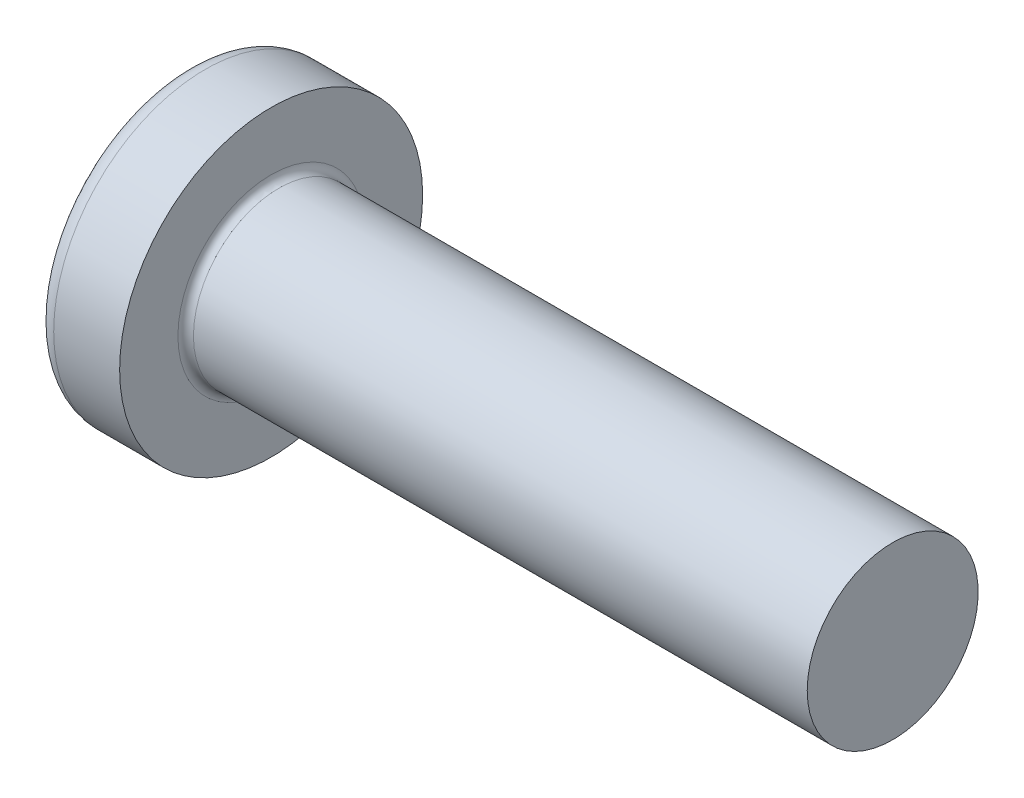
ISO-10303-21;
HEADER;
FILE_DESCRIPTION(('STEP AP214'),'2;1');
FILE_NAME('part.step','',(''),(''),'','','');
FILE_SCHEMA(('AUTOMOTIVE_DESIGN { 1 0 10303 214 1 1 1 1 }'));
ENDSEC;
DATA;
#1=APPLICATION_CONTEXT('core data for automotive mechanical design processes');
#2=APPLICATION_PROTOCOL_DEFINITION('international standard','automotive_design',2000,#1);
#3=PRODUCT_CONTEXT('',#1,'mechanical');
#4=PRODUCT('Part','Part','',(#3));
#5=PRODUCT_RELATED_PRODUCT_CATEGORY('part','',(#4));
#6=PRODUCT_DEFINITION_FORMATION('','',#4);
#7=PRODUCT_DEFINITION_CONTEXT('part definition',#1,'design');
#8=PRODUCT_DEFINITION('design','',#6,#7);
#9=PRODUCT_DEFINITION_SHAPE('','',#8);
#10=(LENGTH_UNIT() NAMED_UNIT(*) SI_UNIT(.MILLI.,.METRE.));
#11=(NAMED_UNIT(*) PLANE_ANGLE_UNIT() SI_UNIT($,.RADIAN.));
#12=(NAMED_UNIT(*) SI_UNIT($,.STERADIAN.) SOLID_ANGLE_UNIT());
#13=UNCERTAINTY_MEASURE_WITH_UNIT(LENGTH_MEASURE(1.E-05),#10,'distance_accuracy_value','');
#14=(GEOMETRIC_REPRESENTATION_CONTEXT(3) GLOBAL_UNCERTAINTY_ASSIGNED_CONTEXT((#13)) GLOBAL_UNIT_ASSIGNED_CONTEXT((#10,
#11,#12)) REPRESENTATION_CONTEXT('',''));
#15=CARTESIAN_POINT('',(0.,0.,0.));
#16=DIRECTION('',(0.,0.,1.));
#17=DIRECTION('',(1.,0.,0.));
#18=AXIS2_PLACEMENT_3D('',#15,#16,#17);
#19=CARTESIAN_POINT('',(1.20000000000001,0.601702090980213,-0.300000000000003));
#20=DIRECTION('',(-1.,0.,0.));
#21=DIRECTION('',(0.,0.,1.));
#22=AXIS2_PLACEMENT_3D('',#19,#20,#21);
#23=PLANE('',#22);
#24=DIRECTION('',(0.,0.,-1.));
#25=VECTOR('',#24,1.);
#26=CARTESIAN_POINT('',(1.20000000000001,0.300000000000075,0.601702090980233));
#27=LINE('',#26,#25);
#28=CARTESIAN_POINT('',(1.2,0.300000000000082,-0.60170209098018));
#29=VERTEX_POINT('',#28);
#30=CARTESIAN_POINT('',(1.19999999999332,0.300000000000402,-0.46811964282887));
#31=VERTEX_POINT('',#30);
#32=EDGE_CURVE('E269',#29,#31,#27,.F.);
#33=ORIENTED_EDGE('',*,*,#32,.F.);
#34=DIRECTION('',(0.,1.,0.));
#35=VECTOR('',#34,1.);
#36=CARTESIAN_POINT('',(1.2,0.300000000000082,-0.601702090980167));
#37=LINE('',#36,#35);
#38=CARTESIAN_POINT('',(1.2,-0.300000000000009,-0.601702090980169));
#39=VERTEX_POINT('',#38);
#40=EDGE_CURVE('E274',#29,#39,#37,.F.);
#41=ORIENTED_EDGE('',*,*,#40,.T.);
#42=DIRECTION('',(0.,0.,1.));
#43=VECTOR('',#42,1.);
#44=CARTESIAN_POINT('',(1.20000000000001,-0.300000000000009,-0.601702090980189));
#45=LINE('',#44,#43);
#46=CARTESIAN_POINT('',(1.19999999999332,-0.300000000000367,-0.468119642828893));
#47=VERTEX_POINT('',#46);
#48=EDGE_CURVE('E321',#47,#39,#45,.F.);
#49=ORIENTED_EDGE('',*,*,#48,.F.);
#50=CARTESIAN_POINT('',(1.20000000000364,0.,0.));
#51=DIRECTION('',(-1.,0.,0.));
#52=DIRECTION('',(0.,0.,1.));
#53=AXIS2_PLACEMENT_3D('',#50,#51,#52);
#54=CIRCLE('',#53,0.556000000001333);
#55=EDGE_CURVE('E764',#47,#31,#54,.F.);
#56=ORIENTED_EDGE('',*,*,#55,.T.);
#57=EDGE_LOOP('',(#33,#41,#49,#56));
#58=FACE_BOUND('',#57,.T.);
#59=ADVANCED_FACE('F16',(#58),#23,.T.);
#60=CARTESIAN_POINT('',(1.20000000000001,0.601702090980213,-0.300000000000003));
#61=DIRECTION('',(-1.,0.,0.));
#62=DIRECTION('',(0.,0.,1.));
#63=AXIS2_PLACEMENT_3D('',#60,#61,#62);
#64=PLANE('',#63);
#65=DIRECTION('',(0.,1.,0.));
#66=VECTOR('',#65,1.);
#67=CARTESIAN_POINT('',(1.20000000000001,-0.601702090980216,0.300000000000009));
#68=LINE('',#67,#66);
#69=CARTESIAN_POINT('',(1.20000000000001,0.601702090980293,0.300000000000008));
#70=VERTEX_POINT('',#69);
#71=CARTESIAN_POINT('',(1.19999999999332,0.468119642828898,0.300000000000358));
#72=VERTEX_POINT('',#71);
#73=EDGE_CURVE('E139',#70,#72,#68,.F.);
#74=ORIENTED_EDGE('',*,*,#73,.F.);
#75=DIRECTION('',(0.,0.,1.));
#76=VECTOR('',#75,1.);
#77=CARTESIAN_POINT('',(1.20000000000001,0.601702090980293,0.300000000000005));
#78=LINE('',#77,#76);
#79=CARTESIAN_POINT('',(1.20000000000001,0.601702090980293,-0.300000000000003));
#80=VERTEX_POINT('',#79);
#81=EDGE_CURVE('E262',#70,#80,#78,.F.);
#82=ORIENTED_EDGE('',*,*,#81,.T.);
#83=DIRECTION('',(0.,-1.,0.));
#84=VECTOR('',#83,1.);
#85=CARTESIAN_POINT('',(1.20000000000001,0.601702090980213,-0.300000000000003));
#86=LINE('',#85,#84);
#87=CARTESIAN_POINT('',(1.19999999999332,0.468119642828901,-0.300000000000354));
#88=VERTEX_POINT('',#87);
#89=EDGE_CURVE('E142',#88,#80,#86,.F.);
#90=ORIENTED_EDGE('',*,*,#89,.F.);
#91=CARTESIAN_POINT('',(1.20000000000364,0.,0.));
#92=DIRECTION('',(-1.,0.,0.));
#93=DIRECTION('',(0.,0.,1.));
#94=AXIS2_PLACEMENT_3D('',#91,#92,#93);
#95=CIRCLE('',#94,0.556000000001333);
#96=EDGE_CURVE('E136',#88,#72,#95,.F.);
#97=ORIENTED_EDGE('',*,*,#96,.T.);
#98=EDGE_LOOP('',(#74,#82,#90,#97));
#99=FACE_BOUND('',#98,.T.);
#100=ADVANCED_FACE('F138',(#99),#64,.T.);
#101=CARTESIAN_POINT('',(1.20000000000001,0.601702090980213,-0.300000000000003));
#102=DIRECTION('',(-1.,0.,0.));
#103=DIRECTION('',(0.,0.,1.));
#104=AXIS2_PLACEMENT_3D('',#101,#102,#103);
#105=PLANE('',#104);
#106=DIRECTION('',(0.,0.,1.));
#107=VECTOR('',#106,1.);
#108=CARTESIAN_POINT('',(1.20000000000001,-0.300000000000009,-0.601702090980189));
#109=LINE('',#108,#107);
#110=CARTESIAN_POINT('',(1.20000000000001,-0.300000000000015,0.601702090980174));
#111=VERTEX_POINT('',#110);
#112=CARTESIAN_POINT('',(1.19999999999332,-0.300000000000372,0.46811964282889));
#113=VERTEX_POINT('',#112);
#114=EDGE_CURVE('E250',#111,#113,#109,.F.);
#115=ORIENTED_EDGE('',*,*,#114,.F.);
#116=DIRECTION('',(0.,1.,0.));
#117=VECTOR('',#116,1.);
#118=CARTESIAN_POINT('',(1.20000000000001,-0.300000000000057,0.601702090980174));
#119=LINE('',#118,#117);
#120=CARTESIAN_POINT('',(1.20000000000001,0.300000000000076,0.601702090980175));
#121=VERTEX_POINT('',#120);
#122=EDGE_CURVE('E255',#111,#121,#119,.T.);
#123=ORIENTED_EDGE('',*,*,#122,.T.);
#124=DIRECTION('',(0.,0.,-1.));
#125=VECTOR('',#124,1.);
#126=CARTESIAN_POINT('',(1.20000000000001,0.300000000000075,0.601702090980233));
#127=LINE('',#126,#125);
#128=CARTESIAN_POINT('',(1.19999999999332,0.30000000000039,0.468119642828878));
#129=VERTEX_POINT('',#128);
#130=EDGE_CURVE('E299',#129,#121,#127,.F.);
#131=ORIENTED_EDGE('',*,*,#130,.F.);
#132=CARTESIAN_POINT('',(1.20000000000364,0.,0.));
#133=DIRECTION('',(-1.,0.,0.));
#134=DIRECTION('',(0.,0.,1.));
#135=AXIS2_PLACEMENT_3D('',#132,#133,#134);
#136=CIRCLE('',#135,0.556000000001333);
#137=EDGE_CURVE('E148',#129,#113,#136,.F.);
#138=ORIENTED_EDGE('',*,*,#137,.T.);
#139=EDGE_LOOP('',(#115,#123,#131,#138));
#140=FACE_BOUND('',#139,.T.);
#141=ADVANCED_FACE('F698',(#140),#105,.T.);
#142=CARTESIAN_POINT('',(1.20000000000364,0.,0.));
#143=DIRECTION('',(-1.,0.,0.));
#144=DIRECTION('',(0.,0.,1.));
#145=AXIS2_PLACEMENT_3D('',#142,#143,#144);
#146=CONICAL_SURFACE('',#145,0.556000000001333,1.25663706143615);
#147=CARTESIAN_POINT('',(1.38065535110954,0.,1.11022302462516E-13));
#148=VERTEX_POINT('',#147);
#149=VERTEX_LOOP('',#148);
#150=FACE_BOUND('',#149,.T.);
#151=CARTESIAN_POINT('',(1.19999999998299,0.,0.));
#152=DIRECTION('',(-1.,0.,0.));
#153=DIRECTION('',(0.,0.,1.));
#154=AXIS2_PLACEMENT_3D('',#151,#152,#153);
#155=CIRCLE('',#154,0.55600000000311);
#156=EDGE_CURVE('E268',#88,#31,#155,.T.);
#157=ORIENTED_EDGE('',*,*,#156,.T.);
#158=ORIENTED_EDGE('',*,*,#55,.F.);
#159=CARTESIAN_POINT('',(1.19999999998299,0.,0.));
#160=DIRECTION('',(-1.,0.,0.));
#161=DIRECTION('',(0.,0.,1.));
#162=AXIS2_PLACEMENT_3D('',#159,#160,#161);
#163=CIRCLE('',#162,0.55600000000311);
#164=CARTESIAN_POINT('',(1.19999999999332,-0.468119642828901,-0.300000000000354));
#165=VERTEX_POINT('',#164);
#166=EDGE_CURVE('E329',#47,#165,#163,.T.);
#167=ORIENTED_EDGE('',*,*,#166,.T.);
#168=CARTESIAN_POINT('',(1.20000000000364,0.,0.));
#169=DIRECTION('',(-1.,0.,0.));
#170=DIRECTION('',(0.,0.,1.));
#171=AXIS2_PLACEMENT_3D('',#168,#169,#170);
#172=CIRCLE('',#171,0.556000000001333);
#173=CARTESIAN_POINT('',(1.19999999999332,-0.468119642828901,0.300000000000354));
#174=VERTEX_POINT('',#173);
#175=EDGE_CURVE('E289',#174,#165,#172,.F.);
#176=ORIENTED_EDGE('',*,*,#175,.F.);
#177=CARTESIAN_POINT('',(1.19999999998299,0.,0.));
#178=DIRECTION('',(-1.,0.,0.));
#179=DIRECTION('',(0.,0.,1.));
#180=AXIS2_PLACEMENT_3D('',#177,#178,#179);
#181=CIRCLE('',#180,0.55600000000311);
#182=EDGE_CURVE('E249',#174,#113,#181,.T.);
#183=ORIENTED_EDGE('',*,*,#182,.T.);
#184=ORIENTED_EDGE('',*,*,#137,.F.);
#185=CARTESIAN_POINT('',(1.19999999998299,0.,0.));
#186=DIRECTION('',(-1.,0.,0.));
#187=DIRECTION('',(0.,0.,1.));
#188=AXIS2_PLACEMENT_3D('',#185,#186,#187);
#189=CIRCLE('',#188,0.55600000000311);
#190=EDGE_CURVE('E161',#129,#72,#189,.T.);
#191=ORIENTED_EDGE('',*,*,#190,.T.);
#192=ORIENTED_EDGE('',*,*,#96,.F.);
#193=EDGE_LOOP('',(#157,#158,#167,#176,#183,#184,#191,#192));
#194=FACE_BOUND('',#193,.T.);
#195=ADVANCED_FACE('F162',(#150,#194),#146,.F.);
#196=CARTESIAN_POINT('',(1.20000000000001,0.601702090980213,-0.300000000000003));
#197=DIRECTION('',(-1.,0.,0.));
#198=DIRECTION('',(0.,0.,1.));
#199=AXIS2_PLACEMENT_3D('',#196,#197,#198);
#200=PLANE('',#199);
#201=DIRECTION('',(0.,-1.,0.));
#202=VECTOR('',#201,1.);
#203=CARTESIAN_POINT('',(1.20000000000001,0.601702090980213,-0.300000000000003));
#204=LINE('',#203,#202);
#205=CARTESIAN_POINT('',(1.20000000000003,-0.601702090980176,-0.299999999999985));
#206=VERTEX_POINT('',#205);
#207=EDGE_CURVE('E285',#206,#165,#204,.F.);
#208=ORIENTED_EDGE('',*,*,#207,.F.);
#209=DIRECTION('',(0.,0.,1.));
#210=VECTOR('',#209,1.);
#211=CARTESIAN_POINT('',(1.20000000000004,-0.601702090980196,-0.299999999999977));
#212=LINE('',#211,#210);
#213=CARTESIAN_POINT('',(1.20000000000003,-0.601702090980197,0.300000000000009));
#214=VERTEX_POINT('',#213);
#215=EDGE_CURVE('E237',#206,#214,#212,.T.);
#216=ORIENTED_EDGE('',*,*,#215,.T.);
#217=DIRECTION('',(0.,1.,0.));
#218=VECTOR('',#217,1.);
#219=CARTESIAN_POINT('',(1.20000000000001,-0.601702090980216,0.300000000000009));
#220=LINE('',#219,#218);
#221=EDGE_CURVE('E243',#174,#214,#220,.F.);
#222=ORIENTED_EDGE('',*,*,#221,.F.);
#223=ORIENTED_EDGE('',*,*,#175,.T.);
#224=EDGE_LOOP('',(#208,#216,#222,#223));
#225=FACE_BOUND('',#224,.T.);
#226=ADVANCED_FACE('F681',(#225),#200,.T.);
#227=CARTESIAN_POINT('',(1.20000000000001,0.601702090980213,-0.300000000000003));
#228=DIRECTION('',(0.,0.,1.));
#229=DIRECTION('',(0.,-1.,0.));
#230=AXIS2_PLACEMENT_3D('',#227,#228,#229);
#231=PLANE('',#230);
#232=CARTESIAN_POINT('',(0.170303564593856,-1.11508977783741,-0.300000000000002));
#233=CARTESIAN_POINT('',(0.143844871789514,-1.02418894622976,-0.300000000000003));
#234=CARTESIAN_POINT('',(0.120668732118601,-0.932580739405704,-0.300000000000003));
#235=CARTESIAN_POINT('',(0.080881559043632,-0.747949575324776,-0.300000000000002));
#236=CARTESIAN_POINT('',(0.0642705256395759,-0.654926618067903,-0.300000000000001));
#237=CARTESIAN_POINT('',(0.0509420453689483,-0.561196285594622,-0.299999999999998));
#238=B_SPLINE_CURVE_WITH_KNOTS('',3,(#232,#233,#234,#235,#236,#237),.UNSPECIFIED.,.F.,.F.,(4,2,
4),(0.,0.283483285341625,0.566966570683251),.UNSPECIFIED.);
#239=CARTESIAN_POINT('',(0.170303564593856,-1.11508977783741,-0.299999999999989));
#240=VERTEX_POINT('',#239);
#241=CARTESIAN_POINT('',(0.0509420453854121,-0.561196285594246,-0.300000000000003));
#242=VERTEX_POINT('',#241);
#243=EDGE_CURVE('E236',#240,#242,#238,.T.);
#244=ORIENTED_EDGE('',*,*,#243,.F.);
#245=DIRECTION('',(0.894934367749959,0.446197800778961,0.));
#246=VECTOR('',#245,1.);
#247=CARTESIAN_POINT('',(0.,-1.20000000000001,-0.299999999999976));
#248=LINE('',#247,#246);
#249=EDGE_CURVE('E240',#240,#206,#248,.T.);
#250=ORIENTED_EDGE('',*,*,#249,.T.);
#251=ORIENTED_EDGE('',*,*,#207,.T.);
#252=CARTESIAN_POINT('',(1.19999999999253,-0.468119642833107,-0.300000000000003));
#253=CARTESIAN_POINT('',(1.00851907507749,-0.483987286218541,-0.300000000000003));
#254=CARTESIAN_POINT('',(0.817023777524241,-0.499677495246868,-0.300000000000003));
#255=CARTESIAN_POINT('',(0.434004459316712,-0.530703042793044,-0.300000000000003));
#256=CARTESIAN_POINT('',(0.24248043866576,-0.546038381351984,-0.300000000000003));
#257=CARTESIAN_POINT('',(0.0509420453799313,-0.561196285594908,-0.300000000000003));
#258=B_SPLINE_CURVE_WITH_KNOTS('',3,(#252,#253,#254,#255,#256,#257),.UNSPECIFIED.,.F.,.F.,(4,2,
4),(0.,0.576411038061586,1.15282200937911),.UNSPECIFIED.);
#259=EDGE_CURVE('E288',#165,#242,#258,.T.);
#260=ORIENTED_EDGE('',*,*,#259,.T.);
#261=EDGE_LOOP('',(#244,#250,#251,#260));
#262=FACE_BOUND('',#261,.T.);
#263=ADVANCED_FACE('F469',(#262),#231,.T.);
#264=CARTESIAN_POINT('',(0.0509420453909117,0.,0.));
#265=DIRECTION('',(-1.,0.,0.));
#266=DIRECTION('',(0.,0.,1.));
#267=AXIS2_PLACEMENT_3D('',#264,#265,#266);
#268=CONICAL_SURFACE('',#267,0.636349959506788,0.0698131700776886);
#269=CARTESIAN_POINT('',(0.0509420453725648,-0.300000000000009,-0.561196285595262));
#270=CARTESIAN_POINT('',(0.242480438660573,-0.300000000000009,-0.546038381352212));
#271=CARTESIAN_POINT('',(0.434004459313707,-0.300000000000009,-0.530703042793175));
#272=CARTESIAN_POINT('',(0.817023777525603,-0.300000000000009,-0.499677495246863));
#273=CARTESIAN_POINT('',(1.00851907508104,-0.300000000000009,-0.483987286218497));
#274=CARTESIAN_POINT('',(1.19999999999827,-0.300000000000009,-0.468119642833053));
#275=B_SPLINE_CURVE_WITH_KNOTS('',3,(#269,#270,#271,#272,#273,#274),.UNSPECIFIED.,.F.,.F.,(4,2,
4),(0.,0.576410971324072,1.15282200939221),.UNSPECIFIED.);
#276=CARTESIAN_POINT('',(0.0509420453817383,-0.300000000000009,-0.561196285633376));
#277=VERTEX_POINT('',#276);
#278=EDGE_CURVE('E326',#277,#47,#275,.T.);
#279=ORIENTED_EDGE('',*,*,#278,.F.);
#280=CARTESIAN_POINT('',(0.0509420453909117,0.,0.));
#281=DIRECTION('',(-1.,0.,0.));
#282=DIRECTION('',(0.,0.,1.));
#283=AXIS2_PLACEMENT_3D('',#280,#281,#282);
#284=CIRCLE('',#283,0.636349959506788);
#285=EDGE_CURVE('E461',#242,#277,#284,.F.);
#286=ORIENTED_EDGE('',*,*,#285,.F.);
#287=ORIENTED_EDGE('',*,*,#259,.F.);
#288=ORIENTED_EDGE('',*,*,#166,.F.);
#289=EDGE_LOOP('',(#279,#286,#287,#288));
#290=FACE_BOUND('',#289,.T.);
#291=ADVANCED_FACE('F442',(#290),#268,.F.);
#292=CARTESIAN_POINT('',(1.20000000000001,-0.300000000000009,-0.601702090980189));
#293=DIRECTION('',(0.,1.,0.));
#294=DIRECTION('',(0.,0.,1.));
#295=AXIS2_PLACEMENT_3D('',#292,#293,#294);
#296=PLANE('',#295);
#297=ORIENTED_EDGE('',*,*,#48,.T.);
#298=DIRECTION('',(-0.894934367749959,0.,-0.44619780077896));
#299=VECTOR('',#298,1.);
#300=CARTESIAN_POINT('',(0.,-0.300000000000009,-1.19999999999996));
#301=LINE('',#300,#299);
#302=CARTESIAN_POINT('',(0.170303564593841,-0.29999999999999,-1.11508977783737));
#303=VERTEX_POINT('',#302);
#304=EDGE_CURVE('E272',#39,#303,#301,.T.);
#305=ORIENTED_EDGE('',*,*,#304,.T.);
#306=CARTESIAN_POINT('',(4.,-0.300000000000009,0.));
#307=DIRECTION('',(0.,1.,0.));
#308=DIRECTION('',(0.,0.,1.));
#309=AXIS2_PLACEMENT_3D('',#306,#307,#308);
#310=CIRCLE('',#309,3.98873413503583);
#311=EDGE_CURVE('E459',#277,#303,#310,.F.);
#312=ORIENTED_EDGE('',*,*,#311,.F.);
#313=ORIENTED_EDGE('',*,*,#278,.T.);
#314=EDGE_LOOP('',(#297,#305,#312,#313));
#315=FACE_BOUND('',#314,.T.);
#316=ADVANCED_FACE('F444',(#315),#296,.T.);
#317=CARTESIAN_POINT('',(0.,0.300000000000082,-1.19999999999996));
#318=DIRECTION('',(0.44619780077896,0.,-0.894934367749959));
#319=DIRECTION('',(-0.894934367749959,0.,-0.44619780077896));
#320=AXIS2_PLACEMENT_3D('',#317,#318,#319);
#321=PLANE('',#320);
#322=ORIENTED_EDGE('',*,*,#40,.F.);
#323=DIRECTION('',(0.894934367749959,0.,0.44619780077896));
#324=VECTOR('',#323,1.);
#325=CARTESIAN_POINT('',(0.170303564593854,0.300000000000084,-1.11508977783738));
#326=LINE('',#325,#324);
#327=CARTESIAN_POINT('',(0.170303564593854,0.300000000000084,-1.11508977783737));
#328=VERTEX_POINT('',#327);
#329=EDGE_CURVE('E265',#328,#29,#326,.T.);
#330=ORIENTED_EDGE('',*,*,#329,.F.);
#331=CARTESIAN_POINT('',(0.170303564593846,-0.299999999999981,-1.11508977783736));
#332=CARTESIAN_POINT('',(0.163473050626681,-0.19999999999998,-1.11849534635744));
#333=CARTESIAN_POINT('',(0.160057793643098,-0.0999999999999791,-1.12019813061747));
#334=CARTESIAN_POINT('',(0.1600577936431,0.100000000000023,-1.12019813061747));
#335=CARTESIAN_POINT('',(0.163473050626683,0.200000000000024,-1.11849534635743));
#336=CARTESIAN_POINT('',(0.170303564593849,0.300000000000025,-1.11508977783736));
#337=B_SPLINE_CURVE_WITH_KNOTS('',3,(#331,#332,#333,#334,#335,#336),.UNSPECIFIED.,.F.,.F.,(4,2,
4),(0.,0.30021837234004,0.60043674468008),.UNSPECIFIED.);
#338=EDGE_CURVE('E453',#303,#328,#337,.T.);
#339=ORIENTED_EDGE('',*,*,#338,.F.);
#340=ORIENTED_EDGE('',*,*,#304,.F.);
#341=EDGE_LOOP('',(#322,#330,#339,#340));
#342=FACE_BOUND('',#341,.T.);
#343=ADVANCED_FACE('F447',(#342),#321,.F.);
#344=CARTESIAN_POINT('',(1.20000000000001,0.300000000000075,0.601702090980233));
#345=DIRECTION('',(0.,-1.,0.));
#346=DIRECTION('',(0.,0.,-1.));
#347=AXIS2_PLACEMENT_3D('',#344,#345,#346);
#348=PLANE('',#347);
#349=CARTESIAN_POINT('',(4.,0.300000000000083,0.));
#350=DIRECTION('',(0.,1.,0.));
#351=DIRECTION('',(0.,0.,1.));
#352=AXIS2_PLACEMENT_3D('',#349,#350,#351);
#353=CIRCLE('',#352,3.98873413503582);
#354=CARTESIAN_POINT('',(0.0509420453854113,0.300000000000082,-0.561196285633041));
#355=VERTEX_POINT('',#354);
#356=EDGE_CURVE('E407',#328,#355,#353,.T.);
#357=ORIENTED_EDGE('',*,*,#356,.F.);
#358=ORIENTED_EDGE('',*,*,#329,.T.);
#359=ORIENTED_EDGE('',*,*,#32,.T.);
#360=CARTESIAN_POINT('',(1.19999999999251,0.300000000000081,-0.468119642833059));
#361=CARTESIAN_POINT('',(1.00851907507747,0.300000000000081,-0.483987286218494));
#362=CARTESIAN_POINT('',(0.817023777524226,0.300000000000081,-0.499677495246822));
#363=CARTESIAN_POINT('',(0.434004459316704,0.300000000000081,-0.530703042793));
#364=CARTESIAN_POINT('',(0.242480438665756,0.300000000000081,-0.546038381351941));
#365=CARTESIAN_POINT('',(0.05094204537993,0.300000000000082,-0.561196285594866));
#366=B_SPLINE_CURVE_WITH_KNOTS('',3,(#360,#361,#362,#363,#364,#365),.UNSPECIFIED.,.F.,.F.,(4,2,
4),(0.,0.576411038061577,1.15282200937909),.UNSPECIFIED.);
#367=EDGE_CURVE('E315',#31,#355,#366,.T.);
#368=ORIENTED_EDGE('',*,*,#367,.T.);
#369=EDGE_LOOP('',(#357,#358,#359,#368));
#370=FACE_BOUND('',#369,.T.);
#371=ADVANCED_FACE('F422',(#370),#348,.T.);
#372=CARTESIAN_POINT('',(0.0509420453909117,0.,0.));
#373=DIRECTION('',(-1.,0.,0.));
#374=DIRECTION('',(0.,0.,1.));
#375=AXIS2_PLACEMENT_3D('',#372,#373,#374);
#376=CONICAL_SURFACE('',#375,0.636349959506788,0.0698131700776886);
#377=ORIENTED_EDGE('',*,*,#367,.F.);
#378=ORIENTED_EDGE('',*,*,#156,.F.);
#379=CARTESIAN_POINT('',(0.0509420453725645,0.561196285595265,-0.300000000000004));
#380=CARTESIAN_POINT('',(0.242480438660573,0.546038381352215,-0.300000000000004));
#381=CARTESIAN_POINT('',(0.434004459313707,0.530703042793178,-0.300000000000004));
#382=CARTESIAN_POINT('',(0.817023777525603,0.499677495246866,-0.300000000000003));
#383=CARTESIAN_POINT('',(1.00851907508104,0.483987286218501,-0.300000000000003));
#384=CARTESIAN_POINT('',(1.19999999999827,0.468119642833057,-0.300000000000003));
#385=B_SPLINE_CURVE_WITH_KNOTS('',3,(#379,#380,#381,#382,#383,#384),.UNSPECIFIED.,.F.,.F.,(4,2,
4),(0.,0.576410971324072,1.15282200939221),.UNSPECIFIED.);
#386=CARTESIAN_POINT('',(0.050942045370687,0.561196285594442,-0.300000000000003));
#387=VERTEX_POINT('',#386);
#388=EDGE_CURVE('E186',#387,#88,#385,.T.);
#389=ORIENTED_EDGE('',*,*,#388,.F.);
#390=CARTESIAN_POINT('',(0.0509420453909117,0.,0.));
#391=DIRECTION('',(-1.,0.,0.));
#392=DIRECTION('',(0.,0.,1.));
#393=AXIS2_PLACEMENT_3D('',#390,#391,#392);
#394=CIRCLE('',#393,0.636349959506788);
#395=EDGE_CURVE('E406',#355,#387,#394,.F.);
#396=ORIENTED_EDGE('',*,*,#395,.F.);
#397=EDGE_LOOP('',(#377,#378,#389,#396));
#398=FACE_BOUND('',#397,.T.);
#399=ADVANCED_FACE('F416',(#398),#376,.F.);
#400=CARTESIAN_POINT('',(1.20000000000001,0.601702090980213,-0.300000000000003));
#401=DIRECTION('',(0.,0.,1.));
#402=DIRECTION('',(0.,-1.,0.));
#403=AXIS2_PLACEMENT_3D('',#400,#401,#402);
#404=PLANE('',#403);
#405=ORIENTED_EDGE('',*,*,#89,.T.);
#406=DIRECTION('',(-0.894934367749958,0.446197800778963,0.));
#407=VECTOR('',#406,1.);
#408=CARTESIAN_POINT('',(1.20000000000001,0.601702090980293,-0.300000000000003));
#409=LINE('',#408,#407);
#410=CARTESIAN_POINT('',(0.170303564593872,1.11508977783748,-0.3));
#411=VERTEX_POINT('',#410);
#412=EDGE_CURVE('E158',#80,#411,#409,.T.);
#413=ORIENTED_EDGE('',*,*,#412,.T.);
#414=CARTESIAN_POINT('',(0.0509420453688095,0.56119628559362,-0.300000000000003));
#415=CARTESIAN_POINT('',(0.0642705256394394,0.654926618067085,-0.300000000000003));
#416=CARTESIAN_POINT('',(0.0808815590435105,0.747949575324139,-0.300000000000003));
#417=CARTESIAN_POINT('',(0.120668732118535,0.932580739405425,-0.300000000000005));
#418=CARTESIAN_POINT('',(0.143844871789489,1.02418894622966,-0.300000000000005));
#419=CARTESIAN_POINT('',(0.170303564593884,1.11508977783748,-0.300000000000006));
#420=B_SPLINE_CURVE_WITH_KNOTS('',3,(#414,#415,#416,#417,#418,#419),.UNSPECIFIED.,.F.,.F.,(4,2,
4),(0.,0.283483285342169,0.566966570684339),.UNSPECIFIED.);
#421=EDGE_CURVE('E403',#387,#411,#420,.T.);
#422=ORIENTED_EDGE('',*,*,#421,.F.);
#423=ORIENTED_EDGE('',*,*,#388,.T.);
#424=EDGE_LOOP('',(#405,#413,#422,#423));
#425=FACE_BOUND('',#424,.T.);
#426=ADVANCED_FACE('F413',(#425),#404,.T.);
#427=CARTESIAN_POINT('',(1.20000000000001,0.601702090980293,0.300000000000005));
#428=DIRECTION('',(0.446197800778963,0.894934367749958,0.));
#429=DIRECTION('',(-0.894934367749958,0.446197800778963,0.));
#430=AXIS2_PLACEMENT_3D('',#427,#428,#429);
#431=PLANE('',#430);
#432=ORIENTED_EDGE('',*,*,#81,.F.);
#433=DIRECTION('',(0.894934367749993,-0.446197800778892,0.));
#434=VECTOR('',#433,1.);
#435=CARTESIAN_POINT('',(0.170303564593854,1.11508977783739,0.300000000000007));
#436=LINE('',#435,#434);
#437=CARTESIAN_POINT('',(0.170303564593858,1.1150897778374,0.300000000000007));
#438=VERTEX_POINT('',#437);
#439=EDGE_CURVE('E157',#438,#70,#436,.T.);
#440=ORIENTED_EDGE('',*,*,#439,.F.);
#441=CARTESIAN_POINT('',(0.170303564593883,1.11508977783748,-0.3));
#442=CARTESIAN_POINT('',(0.163473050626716,1.11849534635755,-0.2));
#443=CARTESIAN_POINT('',(0.160057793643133,1.12019813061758,-0.0999999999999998));
#444=CARTESIAN_POINT('',(0.160057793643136,1.12019813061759,0.100000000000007));
#445=CARTESIAN_POINT('',(0.163473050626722,1.11849534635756,0.200000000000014));
#446=CARTESIAN_POINT('',(0.170303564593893,1.1150897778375,0.300000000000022));
#447=B_SPLINE_CURVE_WITH_KNOTS('',3,(#441,#442,#443,#444,#445,#446),.UNSPECIFIED.,.F.,.F.,(4,2,
4),(0.,0.300218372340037,0.600436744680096),.UNSPECIFIED.);
#448=EDGE_CURVE('E208',#411,#438,#447,.T.);
#449=ORIENTED_EDGE('',*,*,#448,.F.);
#450=ORIENTED_EDGE('',*,*,#412,.F.);
#451=EDGE_LOOP('',(#432,#440,#449,#450));
#452=FACE_BOUND('',#451,.T.);
#453=ADVANCED_FACE('F197',(#452),#431,.F.);
#454=CARTESIAN_POINT('',(1.20000000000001,-0.601702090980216,0.300000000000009));
#455=DIRECTION('',(0.,0.,-1.));
#456=DIRECTION('',(0.,1.,0.));
#457=AXIS2_PLACEMENT_3D('',#454,#455,#456);
#458=PLANE('',#457);
#459=CARTESIAN_POINT('',(0.170303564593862,1.11508977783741,0.300000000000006));
#460=CARTESIAN_POINT('',(0.14384487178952,1.02418894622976,0.300000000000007));
#461=CARTESIAN_POINT('',(0.120668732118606,0.932580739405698,0.300000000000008));
#462=CARTESIAN_POINT('',(0.0808815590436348,0.747949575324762,0.300000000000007));
#463=CARTESIAN_POINT('',(0.064270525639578,0.654926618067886,0.300000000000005));
#464=CARTESIAN_POINT('',(0.0509420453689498,0.561196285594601,0.300000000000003));
#465=B_SPLINE_CURVE_WITH_KNOTS('',3,(#459,#460,#461,#462,#463,#464),.UNSPECIFIED.,.F.,.F.,(4,2,
4),(0.,0.283483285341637,0.566966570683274),.UNSPECIFIED.);
#466=CARTESIAN_POINT('',(0.0509420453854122,0.561196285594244,0.300000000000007));
#467=VERTEX_POINT('',#466);
#468=EDGE_CURVE('E201',#438,#467,#465,.T.);
#469=ORIENTED_EDGE('',*,*,#468,.F.);
#470=ORIENTED_EDGE('',*,*,#439,.T.);
#471=ORIENTED_EDGE('',*,*,#73,.T.);
#472=CARTESIAN_POINT('',(1.19999999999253,0.468119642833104,0.300000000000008));
#473=CARTESIAN_POINT('',(1.00851907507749,0.483987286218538,0.300000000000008));
#474=CARTESIAN_POINT('',(0.81702377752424,0.499677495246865,0.300000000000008));
#475=CARTESIAN_POINT('',(0.434004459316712,0.530703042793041,0.300000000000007));
#476=CARTESIAN_POINT('',(0.24248043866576,0.546038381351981,0.300000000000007));
#477=CARTESIAN_POINT('',(0.0509420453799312,0.561196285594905,0.300000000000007));
#478=B_SPLINE_CURVE_WITH_KNOTS('',3,(#472,#473,#474,#475,#476,#477),.UNSPECIFIED.,.F.,.F.,(4,2,
4),(0.,0.576411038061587,1.15282200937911),.UNSPECIFIED.);
#479=EDGE_CURVE('E155',#72,#467,#478,.T.);
#480=ORIENTED_EDGE('',*,*,#479,.T.);
#481=EDGE_LOOP('',(#469,#470,#471,#480));
#482=FACE_BOUND('',#481,.T.);
#483=ADVANCED_FACE('F153',(#482),#458,.T.);
#484=CARTESIAN_POINT('',(0.0509420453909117,0.,0.));
#485=DIRECTION('',(-1.,0.,0.));
#486=DIRECTION('',(0.,0.,1.));
#487=AXIS2_PLACEMENT_3D('',#484,#485,#486);
#488=CONICAL_SURFACE('',#487,0.636349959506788,0.0698131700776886);
#489=CARTESIAN_POINT('',(0.0509420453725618,0.300000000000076,0.561196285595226));
#490=CARTESIAN_POINT('',(0.24248043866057,0.300000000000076,0.546038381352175));
#491=CARTESIAN_POINT('',(0.434004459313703,0.300000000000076,0.530703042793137));
#492=CARTESIAN_POINT('',(0.817023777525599,0.300000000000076,0.499677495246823));
#493=CARTESIAN_POINT('',(1.00851907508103,0.300000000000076,0.483987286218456));
#494=CARTESIAN_POINT('',(1.19999999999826,0.300000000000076,0.46811964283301));
#495=B_SPLINE_CURVE_WITH_KNOTS('',3,(#489,#490,#491,#492,#493,#494),.UNSPECIFIED.,.F.,.F.,(4,2,
4),(0.,0.576410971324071,1.1528220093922),.UNSPECIFIED.);
#496=CARTESIAN_POINT('',(0.0509420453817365,0.300000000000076,0.561196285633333));
#497=VERTEX_POINT('',#496);
#498=EDGE_CURVE('E166',#497,#129,#495,.T.);
#499=ORIENTED_EDGE('',*,*,#498,.F.);
#500=CARTESIAN_POINT('',(0.0509420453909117,0.,0.));
#501=DIRECTION('',(-1.,0.,0.));
#502=DIRECTION('',(0.,0.,1.));
#503=AXIS2_PLACEMENT_3D('',#500,#501,#502);
#504=CIRCLE('',#503,0.636349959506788);
#505=EDGE_CURVE('E170',#467,#497,#504,.F.);
#506=ORIENTED_EDGE('',*,*,#505,.F.);
#507=ORIENTED_EDGE('',*,*,#479,.F.);
#508=ORIENTED_EDGE('',*,*,#190,.F.);
#509=EDGE_LOOP('',(#499,#506,#507,#508));
#510=FACE_BOUND('',#509,.T.);
#511=ADVANCED_FACE('F168',(#510),#488,.F.);
#512=CARTESIAN_POINT('',(1.20000000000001,0.300000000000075,0.601702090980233));
#513=DIRECTION('',(0.,-1.,0.));
#514=DIRECTION('',(0.,0.,-1.));
#515=AXIS2_PLACEMENT_3D('',#512,#513,#514);
#516=PLANE('',#515);
#517=ORIENTED_EDGE('',*,*,#130,.T.);
#518=DIRECTION('',(0.894934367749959,0.,-0.446197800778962));
#519=VECTOR('',#518,1.);
#520=CARTESIAN_POINT('',(1.20000000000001,0.300000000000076,0.601702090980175));
#521=LINE('',#520,#519);
#522=CARTESIAN_POINT('',(0.170303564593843,0.300000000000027,1.11508977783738));
#523=VERTEX_POINT('',#522);
#524=EDGE_CURVE('E253',#121,#523,#521,.F.);
#525=ORIENTED_EDGE('',*,*,#524,.T.);
#526=CARTESIAN_POINT('',(4.,0.300000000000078,0.));
#527=DIRECTION('',(0.,1.,0.));
#528=DIRECTION('',(0.,0.,1.));
#529=AXIS2_PLACEMENT_3D('',#526,#527,#528);
#530=CIRCLE('',#529,3.98873413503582);
#531=EDGE_CURVE('E395',#497,#523,#530,.T.);
#532=ORIENTED_EDGE('',*,*,#531,.F.);
#533=ORIENTED_EDGE('',*,*,#498,.T.);
#534=EDGE_LOOP('',(#517,#525,#532,#533));
#535=FACE_BOUND('',#534,.T.);
#536=ADVANCED_FACE('F386',(#535),#516,.T.);
#537=CARTESIAN_POINT('',(1.20000000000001,-0.300000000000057,0.601702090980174));
#538=DIRECTION('',(0.446197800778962,0.,0.894934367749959));
#539=DIRECTION('',(0.894934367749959,0.,-0.446197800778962));
#540=AXIS2_PLACEMENT_3D('',#537,#538,#539);
#541=PLANE('',#540);
#542=ORIENTED_EDGE('',*,*,#122,.F.);
#543=DIRECTION('',(0.894934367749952,0.,-0.446197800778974));
#544=VECTOR('',#543,1.);
#545=CARTESIAN_POINT('',(0.170303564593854,-0.300000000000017,1.11508977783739));
#546=LINE('',#545,#544);
#547=CARTESIAN_POINT('',(0.170303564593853,-0.300000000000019,1.11508977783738));
#548=VERTEX_POINT('',#547);
#549=EDGE_CURVE('E246',#548,#111,#546,.T.);
#550=ORIENTED_EDGE('',*,*,#549,.F.);
#551=CARTESIAN_POINT('',(0.170303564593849,0.299999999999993,1.11508977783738));
#552=CARTESIAN_POINT('',(0.163473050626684,0.199999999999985,1.11849534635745));
#553=CARTESIAN_POINT('',(0.160057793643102,0.0999999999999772,1.12019813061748));
#554=CARTESIAN_POINT('',(0.160057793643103,-0.100000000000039,1.12019813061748));
#555=CARTESIAN_POINT('',(0.163473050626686,-0.200000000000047,1.11849534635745));
#556=CARTESIAN_POINT('',(0.170303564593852,-0.300000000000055,1.11508977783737));
#557=B_SPLINE_CURVE_WITH_KNOTS('',3,(#551,#552,#553,#554,#555,#556),.UNSPECIFIED.,.F.,.F.,(4,2,
4),(0.,0.300218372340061,0.600436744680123),.UNSPECIFIED.);
#558=EDGE_CURVE('E389',#523,#548,#557,.T.);
#559=ORIENTED_EDGE('',*,*,#558,.F.);
#560=ORIENTED_EDGE('',*,*,#524,.F.);
#561=EDGE_LOOP('',(#542,#550,#559,#560));
#562=FACE_BOUND('',#561,.T.);
#563=ADVANCED_FACE('F382',(#562),#541,.F.);
#564=CARTESIAN_POINT('',(1.20000000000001,-0.300000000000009,-0.601702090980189));
#565=DIRECTION('',(0.,1.,0.));
#566=DIRECTION('',(0.,0.,1.));
#567=AXIS2_PLACEMENT_3D('',#564,#565,#566);
#568=PLANE('',#567);
#569=CARTESIAN_POINT('',(4.,-0.300000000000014,0.));
#570=DIRECTION('',(0.,1.,0.));
#571=DIRECTION('',(0.,0.,1.));
#572=AXIS2_PLACEMENT_3D('',#569,#570,#571);
#573=CIRCLE('',#572,3.98873413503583);
#574=CARTESIAN_POINT('',(0.0509420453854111,-0.300000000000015,0.561196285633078));
#575=VERTEX_POINT('',#574);
#576=EDGE_CURVE('E394',#548,#575,#573,.F.);
#577=ORIENTED_EDGE('',*,*,#576,.F.);
#578=ORIENTED_EDGE('',*,*,#549,.T.);
#579=ORIENTED_EDGE('',*,*,#114,.T.);
#580=CARTESIAN_POINT('',(1.19999999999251,-0.300000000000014,0.468119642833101));
#581=CARTESIAN_POINT('',(1.00851907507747,-0.300000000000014,0.483987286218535));
#582=CARTESIAN_POINT('',(0.817023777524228,-0.300000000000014,0.499677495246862));
#583=CARTESIAN_POINT('',(0.434004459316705,-0.300000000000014,0.530703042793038));
#584=CARTESIAN_POINT('',(0.242480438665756,-0.300000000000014,0.546038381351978));
#585=CARTESIAN_POINT('',(0.0509420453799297,-0.300000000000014,0.561196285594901));
#586=B_SPLINE_CURVE_WITH_KNOTS('',3,(#580,#581,#582,#583,#584,#585),.UNSPECIFIED.,.F.,.F.,(4,2,
4),(0.,0.576411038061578,1.15282200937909),.UNSPECIFIED.);
#587=EDGE_CURVE('E293',#113,#575,#586,.T.);
#588=ORIENTED_EDGE('',*,*,#587,.T.);
#589=EDGE_LOOP('',(#577,#578,#579,#588));
#590=FACE_BOUND('',#589,.T.);
#591=ADVANCED_FACE('F378',(#590),#568,.T.);
#592=CARTESIAN_POINT('',(0.0509420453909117,0.,0.));
#593=DIRECTION('',(-1.,0.,0.));
#594=DIRECTION('',(0.,0.,1.));
#595=AXIS2_PLACEMENT_3D('',#592,#593,#594);
#596=CONICAL_SURFACE('',#595,0.636349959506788,0.0698131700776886);
#597=ORIENTED_EDGE('',*,*,#587,.F.);
#598=ORIENTED_EDGE('',*,*,#182,.F.);
#599=CARTESIAN_POINT('',(0.0509420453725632,-0.561196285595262,0.300000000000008));
#600=CARTESIAN_POINT('',(0.242480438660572,-0.546038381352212,0.300000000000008));
#601=CARTESIAN_POINT('',(0.434004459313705,-0.530703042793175,0.300000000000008));
#602=CARTESIAN_POINT('',(0.817023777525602,-0.499677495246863,0.300000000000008));
#603=CARTESIAN_POINT('',(1.00851907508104,-0.483987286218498,0.300000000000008));
#604=CARTESIAN_POINT('',(1.19999999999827,-0.468119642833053,0.300000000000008));
#605=B_SPLINE_CURVE_WITH_KNOTS('',3,(#599,#600,#601,#602,#603,#604),.UNSPECIFIED.,.F.,.F.,(4,2,
4),(0.,0.576410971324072,1.15282200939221),.UNSPECIFIED.);
#606=CARTESIAN_POINT('',(0.0509420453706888,-0.561196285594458,0.300000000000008));
#607=VERTEX_POINT('',#606);
#608=EDGE_CURVE('E279',#607,#174,#605,.T.);
#609=ORIENTED_EDGE('',*,*,#608,.F.);
#610=CARTESIAN_POINT('',(0.0509420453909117,0.,0.));
#611=DIRECTION('',(-1.,0.,0.));
#612=DIRECTION('',(0.,0.,1.));
#613=AXIS2_PLACEMENT_3D('',#610,#611,#612);
#614=CIRCLE('',#613,0.636349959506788);
#615=EDGE_CURVE('E353',#575,#607,#614,.F.);
#616=ORIENTED_EDGE('',*,*,#615,.F.);
#617=EDGE_LOOP('',(#597,#598,#609,#616));
#618=FACE_BOUND('',#617,.T.);
#619=ADVANCED_FACE('F359',(#618),#596,.F.);
#620=CARTESIAN_POINT('',(1.20000000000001,-0.601702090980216,0.300000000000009));
#621=DIRECTION('',(0.,0.,-1.));
#622=DIRECTION('',(0.,1.,0.));
#623=AXIS2_PLACEMENT_3D('',#620,#621,#622);
#624=PLANE('',#623);
#625=ORIENTED_EDGE('',*,*,#221,.T.);
#626=DIRECTION('',(0.894934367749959,0.446197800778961,0.));
#627=VECTOR('',#626,1.);
#628=CARTESIAN_POINT('',(0.,-1.20000000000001,0.300000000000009));
#629=LINE('',#628,#627);
#630=CARTESIAN_POINT('',(0.170303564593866,-1.1150897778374,0.300000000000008));
#631=VERTEX_POINT('',#630);
#632=EDGE_CURVE('E234',#214,#631,#629,.F.);
#633=ORIENTED_EDGE('',*,*,#632,.T.);
#634=CARTESIAN_POINT('',(0.0509420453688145,-0.561196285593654,0.300000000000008));
#635=CARTESIAN_POINT('',(0.0642705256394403,-0.654926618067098,0.300000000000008));
#636=CARTESIAN_POINT('',(0.0808815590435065,-0.747949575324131,0.300000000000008));
#637=CARTESIAN_POINT('',(0.12066873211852,-0.932580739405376,0.300000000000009));
#638=CARTESIAN_POINT('',(0.143844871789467,-1.02418894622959,0.300000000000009));
#639=CARTESIAN_POINT('',(0.170303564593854,-1.11508977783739,0.30000000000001));
#640=B_SPLINE_CURVE_WITH_KNOTS('',3,(#634,#635,#636,#637,#638,#639),.UNSPECIFIED.,.F.,.F.,(4,2,
4),(0.,0.283483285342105,0.566966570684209),.UNSPECIFIED.);
#641=EDGE_CURVE('E347',#607,#631,#640,.T.);
#642=ORIENTED_EDGE('',*,*,#641,.F.);
#643=ORIENTED_EDGE('',*,*,#608,.T.);
#644=EDGE_LOOP('',(#625,#633,#642,#643));
#645=FACE_BOUND('',#644,.T.);
#646=ADVANCED_FACE('F355',(#645),#624,.T.);
#647=CARTESIAN_POINT('',(0.,-1.20000000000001,-0.299999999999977));
#648=DIRECTION('',(0.446197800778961,-0.894934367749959,0.));
#649=DIRECTION('',(0.894934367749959,0.446197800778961,0.));
#650=AXIS2_PLACEMENT_3D('',#647,#648,#649);
#651=PLANE('',#650);
#652=ORIENTED_EDGE('',*,*,#215,.F.);
#653=ORIENTED_EDGE('',*,*,#249,.F.);
#654=CARTESIAN_POINT('',(0.170303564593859,-1.11508977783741,0.300000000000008));
#655=CARTESIAN_POINT('',(0.163473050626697,-1.11849534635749,0.200000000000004));
#656=CARTESIAN_POINT('',(0.160057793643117,-1.12019813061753,0.1));
#657=CARTESIAN_POINT('',(0.160057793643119,-1.12019813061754,-0.0999999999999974));
#658=CARTESIAN_POINT('',(0.163473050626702,-1.1184953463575,-0.199999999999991));
#659=CARTESIAN_POINT('',(0.170303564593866,-1.11508977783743,-0.299999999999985));
#660=B_SPLINE_CURVE_WITH_KNOTS('',3,(#654,#655,#656,#657,#658,#659),.UNSPECIFIED.,.F.,.F.,(4,2,
4),(0.,0.300218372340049,0.600436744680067),.UNSPECIFIED.);
#661=EDGE_CURVE('E342',#631,#240,#660,.T.);
#662=ORIENTED_EDGE('',*,*,#661,.F.);
#663=ORIENTED_EDGE('',*,*,#632,.F.);
#664=EDGE_LOOP('',(#652,#653,#662,#663));
#665=FACE_BOUND('',#664,.T.);
#666=ADVANCED_FACE('F221',(#665),#651,.F.);
#667=CARTESIAN_POINT('',(4.,0.,0.));
#668=DIRECTION('',(0.,1.,0.));
#669=DIRECTION('',(1.,0.,0.));
#670=AXIS2_PLACEMENT_3D('',#667,#668,#669);
#671=SPHERICAL_SURFACE('',#670,4.);
#672=CARTESIAN_POINT('',(0.437599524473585,0.,0.));
#673=DIRECTION('',(-1.,0.,0.));
#674=DIRECTION('',(0.,0.,1.));
#675=AXIS2_PLACEMENT_3D('',#672,#673,#674);
#676=CIRCLE('',#675,1.81914893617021);
#677=CARTESIAN_POINT('',(0.437599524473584,0.,1.81914893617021));
#678=VERTEX_POINT('',#677);
#679=EDGE_CURVE('E339',#678,#678,#676,.F.);
#680=ORIENTED_EDGE('',*,*,#679,.F.);
#681=EDGE_LOOP('',(#680));
#682=FACE_BOUND('',#681,.T.);
#683=ORIENTED_EDGE('',*,*,#641,.T.);
#684=ORIENTED_EDGE('',*,*,#661,.T.);
#685=ORIENTED_EDGE('',*,*,#243,.T.);
#686=ORIENTED_EDGE('',*,*,#285,.T.);
#687=ORIENTED_EDGE('',*,*,#311,.T.);
#688=ORIENTED_EDGE('',*,*,#338,.T.);
#689=ORIENTED_EDGE('',*,*,#356,.T.);
#690=ORIENTED_EDGE('',*,*,#395,.T.);
#691=ORIENTED_EDGE('',*,*,#421,.T.);
#692=ORIENTED_EDGE('',*,*,#448,.T.);
#693=ORIENTED_EDGE('',*,*,#468,.T.);
#694=ORIENTED_EDGE('',*,*,#505,.T.);
#695=ORIENTED_EDGE('',*,*,#531,.T.);
#696=ORIENTED_EDGE('',*,*,#558,.T.);
#697=ORIENTED_EDGE('',*,*,#576,.T.);
#698=ORIENTED_EDGE('',*,*,#615,.T.);
#699=EDGE_LOOP('',(#683,#684,#685,#686,#687,#688,#689,#690,#691,#692,#693,#694,#695,#696,#697,#698));
#700=FACE_BOUND('',#699,.T.);
#701=ADVANCED_FACE('F214',(#682,#700),#671,.T.);
#702=CARTESIAN_POINT('',(0.651343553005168,0.,0.));
#703=DIRECTION('',(-1.,0.,0.));
#704=DIRECTION('',(0.,0.,1.));
#705=AXIS2_PLACEMENT_3D('',#702,#703,#704);
#706=TOROIDAL_SURFACE('',#705,1.71,0.24);
#707=ORIENTED_EDGE('',*,*,#679,.T.);
#708=EDGE_LOOP('',(#707));
#709=FACE_BOUND('',#708,.T.);
#710=CARTESIAN_POINT('',(0.651343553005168,0.,0.));
#711=DIRECTION('',(-1.,0.,0.));
#712=DIRECTION('',(0.,0.,1.));
#713=AXIS2_PLACEMENT_3D('',#710,#711,#712);
#714=CIRCLE('',#713,1.95);
#715=CARTESIAN_POINT('',(0.651343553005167,0.,1.95));
#716=VERTEX_POINT('',#715);
#717=EDGE_CURVE('E338',#716,#716,#714,.F.);
#718=ORIENTED_EDGE('',*,*,#717,.F.);
#719=EDGE_LOOP('',(#718));
#720=FACE_BOUND('',#719,.T.);
#721=ADVANCED_FACE('F220',(#709,#720),#706,.T.);
#722=CARTESIAN_POINT('',(-25.3999999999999,0.,0.));
#723=DIRECTION('',(-1.,0.,0.));
#724=DIRECTION('',(0.,0.,1.));
#725=AXIS2_PLACEMENT_3D('',#722,#723,#724);
#726=CYLINDRICAL_SURFACE('',#725,1.95);
#727=ORIENTED_EDGE('',*,*,#717,.T.);
#728=EDGE_LOOP('',(#727));
#729=FACE_BOUND('',#728,.T.);
#730=CARTESIAN_POINT('',(1.5,0.,0.));
#731=DIRECTION('',(-1.,0.,0.));
#732=DIRECTION('',(0.,0.,1.));
#733=AXIS2_PLACEMENT_3D('',#730,#731,#732);
#734=CIRCLE('',#733,1.95);
#735=CARTESIAN_POINT('',(1.5,0.,1.95));
#736=VERTEX_POINT('',#735);
#737=EDGE_CURVE('E334',#736,#736,#734,.T.);
#738=ORIENTED_EDGE('',*,*,#737,.T.);
#739=EDGE_LOOP('',(#738));
#740=FACE_BOUND('',#739,.T.);
#741=ADVANCED_FACE('F519',(#729,#740),#726,.T.);
#742=CARTESIAN_POINT('',(1.5,1.10000000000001,0.));
#743=DIRECTION('',(-1.,0.,0.));
#744=DIRECTION('',(0.,0.,1.));
#745=AXIS2_PLACEMENT_3D('',#742,#743,#744);
#746=PLANE('',#745);
#747=ORIENTED_EDGE('',*,*,#737,.F.);
#748=EDGE_LOOP('',(#747));
#749=FACE_BOUND('',#748,.T.);
#750=CARTESIAN_POINT('',(1.49999999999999,0.,0.));
#751=DIRECTION('',(1.,0.,0.));
#752=DIRECTION('',(0.,0.,1.));
#753=AXIS2_PLACEMENT_3D('',#750,#751,#752);
#754=CIRCLE('',#753,1.2);
#755=CARTESIAN_POINT('',(1.49999999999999,0.,-1.2));
#756=VERTEX_POINT('',#755);
#757=CARTESIAN_POINT('',(1.49999999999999,0.,1.2));
#758=VERTEX_POINT('',#757);
#759=EDGE_CURVE('E337',#756,#758,#754,.F.);
#760=ORIENTED_EDGE('',*,*,#759,.T.);
#761=CARTESIAN_POINT('',(1.49999999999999,0.,0.));
#762=DIRECTION('',(1.,0.,0.));
#763=DIRECTION('',(0.,0.,-1.));
#764=AXIS2_PLACEMENT_3D('',#761,#762,#763);
#765=CIRCLE('',#764,1.2);
#766=EDGE_CURVE('E35',#758,#756,#765,.F.);
#767=ORIENTED_EDGE('',*,*,#766,.T.);
#768=EDGE_LOOP('',(#760,#767));
#769=FACE_BOUND('',#768,.T.);
#770=ADVANCED_FACE('F511',(#749,#769),#746,.F.);
#771=CARTESIAN_POINT('',(9.49999999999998,1.10000000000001,0.));
#772=DIRECTION('',(1.,0.,0.));
#773=DIRECTION('',(0.,0.,-1.));
#774=AXIS2_PLACEMENT_3D('',#771,#772,#773);
#775=PLANE('',#774);
#776=CARTESIAN_POINT('',(9.49999999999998,0.,0.));
#777=DIRECTION('',(-1.,0.,0.));
#778=DIRECTION('',(0.,0.,1.));
#779=AXIS2_PLACEMENT_3D('',#776,#777,#778);
#780=CIRCLE('',#779,1.1);
#781=CARTESIAN_POINT('',(9.49999999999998,0.,1.1));
#782=VERTEX_POINT('',#781);
#783=EDGE_CURVE('E27',#782,#782,#780,.T.);
#784=ORIENTED_EDGE('',*,*,#783,.F.);
#785=EDGE_LOOP('',(#784));
#786=FACE_BOUND('',#785,.T.);
#787=ADVANCED_FACE('F496',(#786),#775,.T.);
#788=CARTESIAN_POINT('',(1.59999999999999,0.,0.));
#789=DIRECTION('',(-1.,0.,0.));
#790=DIRECTION('',(0.,0.,1.));
#791=AXIS2_PLACEMENT_3D('',#788,#789,#790);
#792=TOROIDAL_SURFACE('',#791,1.2,0.1);
#793=ORIENTED_EDGE('',*,*,#766,.F.);
#794=ORIENTED_EDGE('',*,*,#759,.F.);
#795=EDGE_LOOP('',(#793,#794));
#796=FACE_BOUND('',#795,.T.);
#797=CARTESIAN_POINT('',(1.59999999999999,0.,0.));
#798=DIRECTION('',(-1.,0.,0.));
#799=DIRECTION('',(0.,0.,1.));
#800=AXIS2_PLACEMENT_3D('',#797,#798,#799);
#801=CIRCLE('',#800,1.1);
#802=CARTESIAN_POINT('',(1.59999999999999,0.,1.1));
#803=VERTEX_POINT('',#802);
#804=EDGE_CURVE('E11',#803,#803,#801,.F.);
#805=ORIENTED_EDGE('',*,*,#804,.F.);
#806=EDGE_LOOP('',(#805));
#807=FACE_BOUND('',#806,.T.);
#808=ADVANCED_FACE('F490',(#796,#807),#792,.F.);
#809=CARTESIAN_POINT('',(-25.3999999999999,0.,0.));
#810=DIRECTION('',(-1.,0.,0.));
#811=DIRECTION('',(0.,0.,1.));
#812=AXIS2_PLACEMENT_3D('',#809,#810,#811);
#813=CYLINDRICAL_SURFACE('',#812,1.1);
#814=ORIENTED_EDGE('',*,*,#804,.T.);
#815=EDGE_LOOP('',(#814));
#816=FACE_BOUND('',#815,.T.);
#817=ORIENTED_EDGE('',*,*,#783,.T.);
#818=EDGE_LOOP('',(#817));
#819=FACE_BOUND('',#818,.T.);
#820=ADVANCED_FACE('F488',(#816,#819),#813,.T.);
#821=CLOSED_SHELL('',(#59,#100,#141,#195,#226,#263,#291,#316,#343,#371,#399,#426,#453,#483,#511,
#536,#563,#591,#619,#646,#666,#701,#721,#741,#770,#787,#808,#820));
#822=MANIFOLD_SOLID_BREP('B1',#821);
#823=ADVANCED_BREP_SHAPE_REPRESENTATION('',(#18,#822),#14);
#824=SHAPE_DEFINITION_REPRESENTATION(#9,#823);
ENDSEC;
END-ISO-10303-21;
